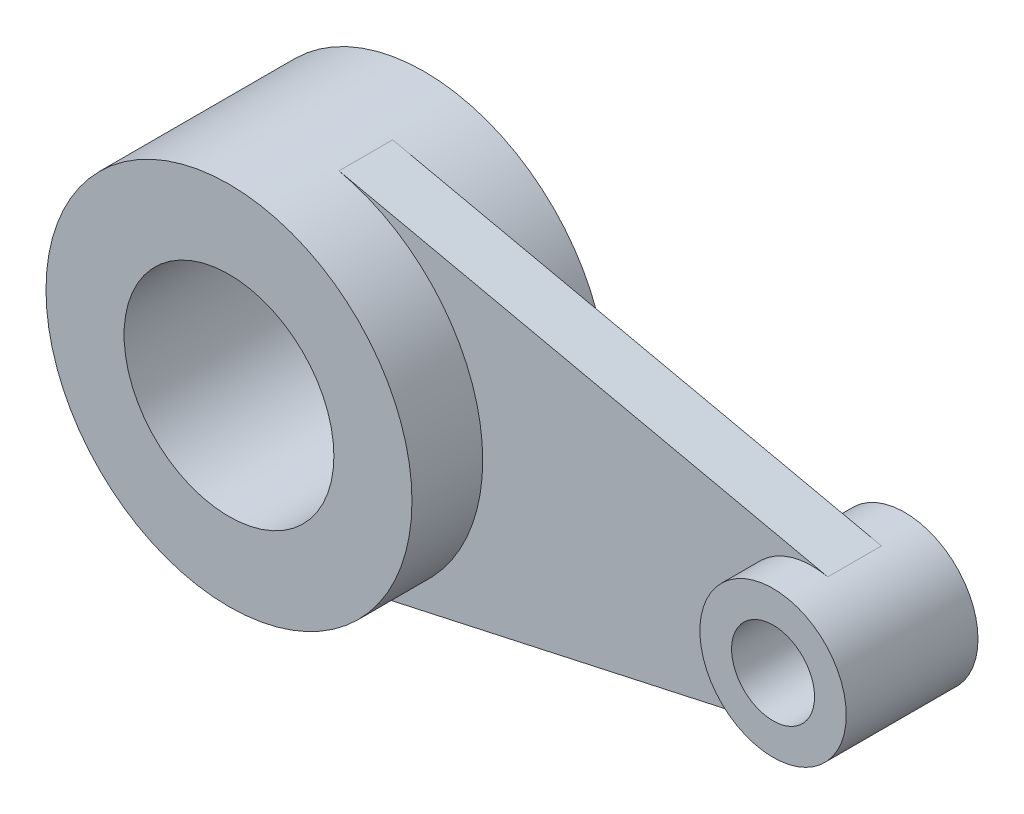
from build123d import *

# Parameters (mm, degrees)
SKETCH1_R           = 37.5
SKETCH1_R_2         = 21.5
BOSS_EXTRUDE1_DEPTH = 20
BOSS_EXTRUDE2_DEPTH = 5.5
SKETCH1_7_R         = 15
SKETCH1_7_R_2       = 8.5
BOSS_EXTRUDE3_DEPTH = 13.5


with BuildPart() as part:
    # Sketch1 → Boss-Extrude1 (new, symmetric)
    with BuildSketch(Plane.XY):
        Circle(SKETCH1_R)
        Circle(SKETCH1_R_2, mode=Mode.SUBTRACT)
    extrude(amount=BOSS_EXTRUDE1_DEPTH, both=True)

    # Sketch1_6 → Boss-Extrude2 (add, symmetric)
    with BuildSketch(Plane.XY):
        with BuildLine():
            ThreePointArc((108.214285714, -14.651565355), (90, 0), (108.214285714, 14.651565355))
            Line((108.214285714, 14.651565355), (8.035714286, 36.628913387))
            ThreePointArc((8.035714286, 36.628913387), (29.219764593, 23.504368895), (37.5, 0))
            ThreePointArc((37.5, 0), (29.219764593, -23.504368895), (8.035714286, -36.628913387))
            Line((8.035714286, -36.628913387), (108.214285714, -14.651565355))
        make_face()
    extrude(amount=BOSS_EXTRUDE2_DEPTH, both=True)

    # Sketch1_7 → Boss-Extrude3 (add, symmetric)
    with BuildSketch(Plane.XY):
        with Locations((105, 0)):
            Circle(SKETCH1_7_R)
        with Locations((105, 0)):
            Circle(SKETCH1_7_R_2, mode=Mode.SUBTRACT)
    extrude(amount=BOSS_EXTRUDE3_DEPTH, both=True)


solid = part.part
